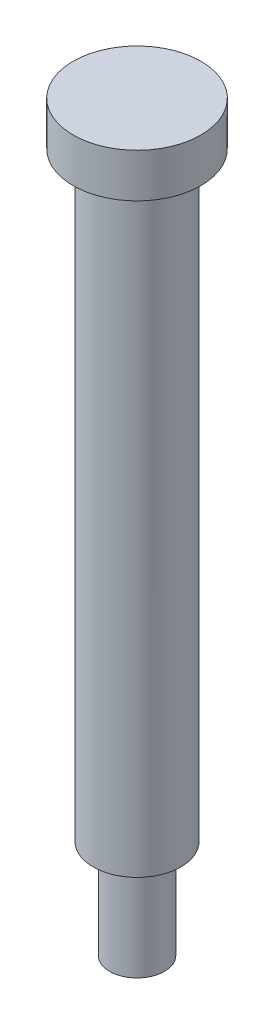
ISO-10303-21;
HEADER;
FILE_DESCRIPTION(('STEP AP214'),'2;1');
FILE_NAME('part.step','',(''),(''),'','','');
FILE_SCHEMA(('AUTOMOTIVE_DESIGN { 1 0 10303 214 1 1 1 1 }'));
ENDSEC;
DATA;
#1=APPLICATION_CONTEXT('core data for automotive mechanical design processes');
#2=APPLICATION_PROTOCOL_DEFINITION('international standard','automotive_design',2000,#1);
#3=PRODUCT_CONTEXT('',#1,'mechanical');
#4=PRODUCT('Part','Part','',(#3));
#5=PRODUCT_RELATED_PRODUCT_CATEGORY('part','',(#4));
#6=PRODUCT_DEFINITION_FORMATION('','',#4);
#7=PRODUCT_DEFINITION_CONTEXT('part definition',#1,'design');
#8=PRODUCT_DEFINITION('design','',#6,#7);
#9=PRODUCT_DEFINITION_SHAPE('','',#8);
#10=(LENGTH_UNIT() NAMED_UNIT(*) SI_UNIT(.MILLI.,.METRE.));
#11=(NAMED_UNIT(*) PLANE_ANGLE_UNIT() SI_UNIT($,.RADIAN.));
#12=(NAMED_UNIT(*) SI_UNIT($,.STERADIAN.) SOLID_ANGLE_UNIT());
#13=UNCERTAINTY_MEASURE_WITH_UNIT(LENGTH_MEASURE(1.E-05),#10,'distance_accuracy_value','');
#14=(GEOMETRIC_REPRESENTATION_CONTEXT(3) GLOBAL_UNCERTAINTY_ASSIGNED_CONTEXT((#13)) GLOBAL_UNIT_ASSIGNED_CONTEXT((#10,
#11,#12)) REPRESENTATION_CONTEXT('',''));
#15=CARTESIAN_POINT('',(0.,0.,0.));
#16=DIRECTION('',(0.,0.,1.));
#17=DIRECTION('',(1.,0.,0.));
#18=AXIS2_PLACEMENT_3D('',#15,#16,#17);
#19=CARTESIAN_POINT('',(0.,842.551730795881,0.));
#20=DIRECTION('',(0.,-1.,0.));
#21=DIRECTION('',(0.,0.,-1.));
#22=AXIS2_PLACEMENT_3D('',#19,#20,#21);
#23=CYLINDRICAL_SURFACE('',#22,12.7);
#24=CARTESIAN_POINT('',(0.,829.85173079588,0.));
#25=DIRECTION('',(0.,1.,0.));
#26=DIRECTION('',(-1.,0.,0.));
#27=AXIS2_PLACEMENT_3D('',#24,#25,#26);
#28=CIRCLE('',#27,12.7);
#29=CARTESIAN_POINT('',(-12.7,829.85173079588,0.));
#30=VERTEX_POINT('',#29);
#31=EDGE_CURVE('E61',#30,#30,#28,.T.);
#32=ORIENTED_EDGE('',*,*,#31,.T.);
#33=EDGE_LOOP('',(#32));
#34=FACE_BOUND('',#33,.T.);
#35=CARTESIAN_POINT('',(0.,1003.52423079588,0.));
#36=DIRECTION('',(0.,-1.,0.));
#37=DIRECTION('',(0.,0.,-1.));
#38=AXIS2_PLACEMENT_3D('',#35,#36,#37);
#39=CIRCLE('',#38,12.7);
#40=CARTESIAN_POINT('',(0.,1003.52423079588,-12.7));
#41=VERTEX_POINT('',#40);
#42=EDGE_CURVE('E10',#41,#41,#39,.T.);
#43=ORIENTED_EDGE('',*,*,#42,.T.);
#44=EDGE_LOOP('',(#43));
#45=FACE_BOUND('',#44,.T.);
#46=ADVANCED_FACE('F29',(#34,#45),#23,.T.);
#47=CARTESIAN_POINT('',(-18.494375,1003.52423079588,0.));
#48=DIRECTION('',(0.,1.,0.));
#49=DIRECTION('',(0.,0.,1.));
#50=AXIS2_PLACEMENT_3D('',#47,#48,#49);
#51=PLANE('',#50);
#52=ORIENTED_EDGE('',*,*,#42,.F.);
#53=EDGE_LOOP('',(#52));
#54=FACE_BOUND('',#53,.T.);
#55=CARTESIAN_POINT('',(0.,1003.52423079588,0.));
#56=DIRECTION('',(0.,-1.,0.));
#57=DIRECTION('',(0.,0.,-1.));
#58=AXIS2_PLACEMENT_3D('',#55,#56,#57);
#59=CIRCLE('',#58,18.494375);
#60=CARTESIAN_POINT('',(0.,1003.52423079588,-18.494375));
#61=VERTEX_POINT('',#60);
#62=EDGE_CURVE('E36',#61,#61,#59,.T.);
#63=ORIENTED_EDGE('',*,*,#62,.T.);
#64=EDGE_LOOP('',(#63));
#65=FACE_BOUND('',#64,.T.);
#66=ADVANCED_FACE('F101',(#54,#65),#51,.F.);
#67=CARTESIAN_POINT('',(0.,842.551730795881,0.));
#68=DIRECTION('',(0.,-1.,0.));
#69=DIRECTION('',(0.,0.,-1.));
#70=AXIS2_PLACEMENT_3D('',#67,#68,#69);
#71=CYLINDRICAL_SURFACE('',#70,18.494375);
#72=ORIENTED_EDGE('',*,*,#62,.F.);
#73=EDGE_LOOP('',(#72));
#74=FACE_BOUND('',#73,.T.);
#75=CARTESIAN_POINT('',(0.,1016.22423079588,0.));
#76=DIRECTION('',(0.,-1.,0.));
#77=DIRECTION('',(0.,0.,-1.));
#78=AXIS2_PLACEMENT_3D('',#75,#76,#77);
#79=CIRCLE('',#78,18.494375);
#80=CARTESIAN_POINT('',(0.,1016.22423079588,-18.494375));
#81=VERTEX_POINT('',#80);
#82=EDGE_CURVE('E40',#81,#81,#79,.T.);
#83=ORIENTED_EDGE('',*,*,#82,.T.);
#84=EDGE_LOOP('',(#83));
#85=FACE_BOUND('',#84,.T.);
#86=ADVANCED_FACE('F105',(#74,#85),#71,.T.);
#87=CARTESIAN_POINT('',(-18.494375,1016.22423079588,0.));
#88=DIRECTION('',(0.,-1.,0.));
#89=DIRECTION('',(0.,0.,-1.));
#90=AXIS2_PLACEMENT_3D('',#87,#88,#89);
#91=PLANE('',#90);
#92=ORIENTED_EDGE('',*,*,#82,.F.);
#93=EDGE_LOOP('',(#92));
#94=FACE_BOUND('',#93,.T.);
#95=ADVANCED_FACE('F93',(#94),#91,.F.);
#96=CARTESIAN_POINT('',(0.,1018.76423079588,0.));
#97=DIRECTION('',(0.,1.,0.));
#98=DIRECTION('',(-1.,0.,0.));
#99=AXIS2_PLACEMENT_3D('',#96,#97,#98);
#100=CYLINDRICAL_SURFACE('',#99,7.93750000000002);
#101=CARTESIAN_POINT('',(0.,827.921330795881,0.));
#102=DIRECTION('',(0.,1.,0.));
#103=DIRECTION('',(-1.,0.,0.));
#104=AXIS2_PLACEMENT_3D('',#101,#102,#103);
#105=CIRCLE('',#104,7.93750000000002);
#106=CARTESIAN_POINT('',(-7.93750000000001,827.921330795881,0.));
#107=VERTEX_POINT('',#106);
#108=EDGE_CURVE('E49',#107,#107,#105,.T.);
#109=ORIENTED_EDGE('',*,*,#108,.F.);
#110=EDGE_LOOP('',(#109));
#111=FACE_BOUND('',#110,.T.);
#112=CARTESIAN_POINT('',(0.,801.276730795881,0.));
#113=DIRECTION('',(0.,1.,0.));
#114=DIRECTION('',(-1.,0.,0.));
#115=AXIS2_PLACEMENT_3D('',#112,#113,#114);
#116=CIRCLE('',#115,7.93750000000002);
#117=CARTESIAN_POINT('',(-7.9375,801.276730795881,0.));
#118=VERTEX_POINT('',#117);
#119=EDGE_CURVE('E44',#118,#118,#116,.T.);
#120=ORIENTED_EDGE('',*,*,#119,.T.);
#121=EDGE_LOOP('',(#120));
#122=FACE_BOUND('',#121,.T.);
#123=ADVANCED_FACE('F87',(#111,#122),#100,.T.);
#124=CARTESIAN_POINT('',(0.,828.70873079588,0.));
#125=DIRECTION('',(0.,1.,0.));
#126=DIRECTION('',(-1.,0.,0.));
#127=AXIS2_PLACEMENT_3D('',#124,#125,#126);
#128=TOROIDAL_SURFACE('',#127,7.93750000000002,0.787399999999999);
#129=CARTESIAN_POINT('',(0.,828.70873079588,0.));
#130=DIRECTION('',(0.,1.,0.));
#131=DIRECTION('',(-1.,0.,0.));
#132=AXIS2_PLACEMENT_3D('',#129,#130,#131);
#133=CIRCLE('',#132,7.15010000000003);
#134=CARTESIAN_POINT('',(-7.15010000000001,828.70873079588,0.));
#135=VERTEX_POINT('',#134);
#136=EDGE_CURVE('E52',#135,#135,#133,.T.);
#137=ORIENTED_EDGE('',*,*,#136,.F.);
#138=EDGE_LOOP('',(#137));
#139=FACE_BOUND('',#138,.T.);
#140=ORIENTED_EDGE('',*,*,#108,.T.);
#141=EDGE_LOOP('',(#140));
#142=FACE_BOUND('',#141,.T.);
#143=ADVANCED_FACE('F81',(#139,#142),#128,.F.);
#144=CARTESIAN_POINT('',(0.,1018.76423079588,0.));
#145=DIRECTION('',(0.,1.,0.));
#146=DIRECTION('',(-1.,0.,0.));
#147=AXIS2_PLACEMENT_3D('',#144,#145,#146);
#148=CYLINDRICAL_SURFACE('',#147,7.15010000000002);
#149=CARTESIAN_POINT('',(0.,829.06433079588,0.));
#150=DIRECTION('',(0.,1.,0.));
#151=DIRECTION('',(-1.,0.,0.));
#152=AXIS2_PLACEMENT_3D('',#149,#150,#151);
#153=CIRCLE('',#152,7.15010000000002);
#154=CARTESIAN_POINT('',(-7.15010000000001,829.06433079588,0.));
#155=VERTEX_POINT('',#154);
#156=EDGE_CURVE('E55',#155,#155,#153,.T.);
#157=ORIENTED_EDGE('',*,*,#156,.F.);
#158=EDGE_LOOP('',(#157));
#159=FACE_BOUND('',#158,.T.);
#160=ORIENTED_EDGE('',*,*,#136,.T.);
#161=EDGE_LOOP('',(#160));
#162=FACE_BOUND('',#161,.T.);
#163=ADVANCED_FACE('F75',(#159,#162),#148,.T.);
#164=CARTESIAN_POINT('',(0.,829.06433079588,0.));
#165=DIRECTION('',(0.,1.,0.));
#166=DIRECTION('',(-1.,0.,0.));
#167=AXIS2_PLACEMENT_3D('',#164,#165,#166);
#168=TOROIDAL_SURFACE('',#167,7.93750000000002,0.787399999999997);
#169=CARTESIAN_POINT('',(0.,829.85173079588,0.));
#170=DIRECTION('',(0.,1.,0.));
#171=DIRECTION('',(-1.,0.,0.));
#172=AXIS2_PLACEMENT_3D('',#169,#170,#171);
#173=CIRCLE('',#172,7.93750000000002);
#174=CARTESIAN_POINT('',(-7.93750000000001,829.85173079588,0.));
#175=VERTEX_POINT('',#174);
#176=EDGE_CURVE('E58',#175,#175,#173,.T.);
#177=ORIENTED_EDGE('',*,*,#176,.F.);
#178=EDGE_LOOP('',(#177));
#179=FACE_BOUND('',#178,.T.);
#180=ORIENTED_EDGE('',*,*,#156,.T.);
#181=EDGE_LOOP('',(#180));
#182=FACE_BOUND('',#181,.T.);
#183=ADVANCED_FACE('F69',(#179,#182),#168,.F.);
#184=CARTESIAN_POINT('',(-7.93750000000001,829.85173079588,0.));
#185=DIRECTION('',(0.,1.,0.));
#186=DIRECTION('',(-1.,0.,0.));
#187=AXIS2_PLACEMENT_3D('',#184,#185,#186);
#188=PLANE('',#187);
#189=ORIENTED_EDGE('',*,*,#31,.F.);
#190=EDGE_LOOP('',(#189));
#191=FACE_BOUND('',#190,.T.);
#192=ORIENTED_EDGE('',*,*,#176,.T.);
#193=EDGE_LOOP('',(#192));
#194=FACE_BOUND('',#193,.T.);
#195=ADVANCED_FACE('F66',(#191,#194),#188,.F.);
#196=CARTESIAN_POINT('',(0.,801.276730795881,0.));
#197=DIRECTION('',(0.,1.,0.));
#198=DIRECTION('',(0.,0.,1.));
#199=AXIS2_PLACEMENT_3D('',#196,#197,#198);
#200=PLANE('',#199);
#201=ORIENTED_EDGE('',*,*,#119,.F.);
#202=EDGE_LOOP('',(#201));
#203=FACE_BOUND('',#202,.T.);
#204=ADVANCED_FACE('F31',(#203),#200,.F.);
#205=CLOSED_SHELL('',(#46,#66,#86,#95,#123,#143,#163,#183,#195,#204));
#206=MANIFOLD_SOLID_BREP('B2',#205);
#207=ADVANCED_BREP_SHAPE_REPRESENTATION('',(#18,#206),#14);
#208=SHAPE_DEFINITION_REPRESENTATION(#9,#207);
ENDSEC;
END-ISO-10303-21;
